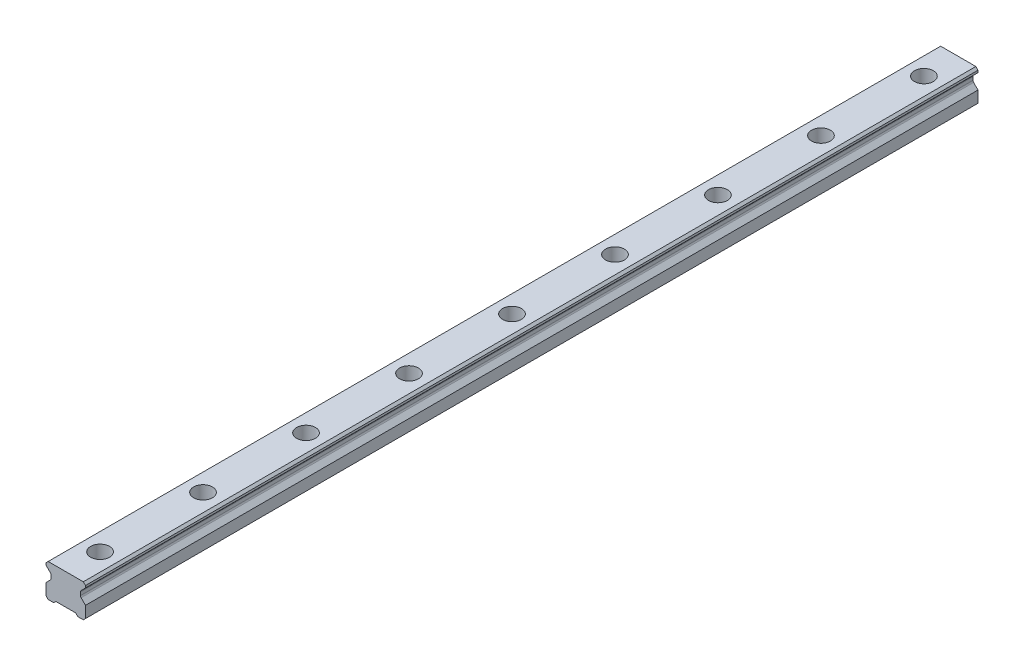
ISO-10303-21;
HEADER;
FILE_DESCRIPTION(('STEP AP214'),'2;1');
FILE_NAME('part.step','',(''),(''),'','','');
FILE_SCHEMA(('AUTOMOTIVE_DESIGN { 1 0 10303 214 1 1 1 1 }'));
ENDSEC;
DATA;
#1=APPLICATION_CONTEXT('core data for automotive mechanical design processes');
#2=APPLICATION_PROTOCOL_DEFINITION('international standard','automotive_design',2000,#1);
#3=PRODUCT_CONTEXT('',#1,'mechanical');
#4=PRODUCT('Part','Part','',(#3));
#5=PRODUCT_RELATED_PRODUCT_CATEGORY('part','',(#4));
#6=PRODUCT_DEFINITION_FORMATION('','',#4);
#7=PRODUCT_DEFINITION_CONTEXT('part definition',#1,'design');
#8=PRODUCT_DEFINITION('design','',#6,#7);
#9=PRODUCT_DEFINITION_SHAPE('','',#8);
#10=(LENGTH_UNIT() NAMED_UNIT(*) SI_UNIT(.MILLI.,.METRE.));
#11=(NAMED_UNIT(*) PLANE_ANGLE_UNIT() SI_UNIT($,.RADIAN.));
#12=(NAMED_UNIT(*) SI_UNIT($,.STERADIAN.) SOLID_ANGLE_UNIT());
#13=UNCERTAINTY_MEASURE_WITH_UNIT(LENGTH_MEASURE(1.E-05),#10,'distance_accuracy_value','');
#14=(GEOMETRIC_REPRESENTATION_CONTEXT(3) GLOBAL_UNCERTAINTY_ASSIGNED_CONTEXT((#13)) GLOBAL_UNIT_ASSIGNED_CONTEXT((#10,
#11,#12)) REPRESENTATION_CONTEXT('',''));
#15=CARTESIAN_POINT('',(0.,0.,0.));
#16=DIRECTION('',(0.,0.,1.));
#17=DIRECTION('',(1.,0.,0.));
#18=AXIS2_PLACEMENT_3D('',#15,#16,#17);
#19=CARTESIAN_POINT('',(0.,10.2,-240.));
#20=DIRECTION('',(0.,1.,0.));
#21=DIRECTION('',(0.,0.,1.));
#22=AXIS2_PLACEMENT_3D('',#19,#20,#21);
#23=PLANE('',#22);
#24=CARTESIAN_POINT('',(0.,10.2,-240.));
#25=DIRECTION('',(0.,1.,0.));
#26=DIRECTION('',(0.,0.,1.));
#27=AXIS2_PLACEMENT_3D('',#24,#25,#26);
#28=CIRCLE('',#27,3.5);
#29=CARTESIAN_POINT('',(0.,10.2,-236.5));
#30=VERTEX_POINT('',#29);
#31=EDGE_CURVE('E415',#30,#30,#28,.T.);
#32=ORIENTED_EDGE('',*,*,#31,.F.);
#33=EDGE_LOOP('',(#32));
#34=FACE_BOUND('',#33,.T.);
#35=CARTESIAN_POINT('',(0.,10.2,-240.));
#36=DIRECTION('',(0.,1.,0.));
#37=DIRECTION('',(0.,0.,1.));
#38=AXIS2_PLACEMENT_3D('',#35,#36,#37);
#39=CIRCLE('',#38,5.5);
#40=CARTESIAN_POINT('',(0.,10.2,-234.5));
#41=VERTEX_POINT('',#40);
#42=EDGE_CURVE('E11',#41,#41,#39,.T.);
#43=ORIENTED_EDGE('',*,*,#42,.T.);
#44=EDGE_LOOP('',(#43));
#45=FACE_BOUND('',#44,.T.);
#46=ADVANCED_FACE('F39',(#34,#45),#23,.T.);
#47=CARTESIAN_POINT('',(0.,10.2,-240.));
#48=DIRECTION('',(0.,1.,0.));
#49=DIRECTION('',(0.,0.,1.));
#50=AXIS2_PLACEMENT_3D('',#47,#48,#49);
#51=CYLINDRICAL_SURFACE('',#50,5.5);
#52=ORIENTED_EDGE('',*,*,#42,.F.);
#53=EDGE_LOOP('',(#52));
#54=FACE_BOUND('',#53,.T.);
#55=CARTESIAN_POINT('',(0.,19.2,-240.));
#56=DIRECTION('',(0.,1.,0.));
#57=DIRECTION('',(0.,0.,1.));
#58=AXIS2_PLACEMENT_3D('',#55,#56,#57);
#59=CIRCLE('',#58,5.5);
#60=CARTESIAN_POINT('',(0.,19.2,-234.5));
#61=VERTEX_POINT('',#60);
#62=EDGE_CURVE('E48',#61,#61,#59,.T.);
#63=ORIENTED_EDGE('',*,*,#62,.T.);
#64=EDGE_LOOP('',(#63));
#65=FACE_BOUND('',#64,.T.);
#66=ADVANCED_FACE('F688',(#54,#65),#51,.F.);
#67=CARTESIAN_POINT('',(0.,10.2,-180.));
#68=DIRECTION('',(0.,1.,0.));
#69=DIRECTION('',(0.,0.,1.));
#70=AXIS2_PLACEMENT_3D('',#67,#68,#69);
#71=PLANE('',#70);
#72=CARTESIAN_POINT('',(0.,10.2,-180.));
#73=DIRECTION('',(0.,1.,0.));
#74=DIRECTION('',(0.,0.,1.));
#75=AXIS2_PLACEMENT_3D('',#72,#73,#74);
#76=CIRCLE('',#75,3.5);
#77=CARTESIAN_POINT('',(0.,10.2,-176.5));
#78=VERTEX_POINT('',#77);
#79=EDGE_CURVE('E420',#78,#78,#76,.T.);
#80=ORIENTED_EDGE('',*,*,#79,.F.);
#81=EDGE_LOOP('',(#80));
#82=FACE_BOUND('',#81,.T.);
#83=CARTESIAN_POINT('',(0.,10.2,-180.));
#84=DIRECTION('',(0.,1.,0.));
#85=DIRECTION('',(0.,0.,1.));
#86=AXIS2_PLACEMENT_3D('',#83,#84,#85);
#87=CIRCLE('',#86,5.5);
#88=CARTESIAN_POINT('',(0.,10.2,-174.5));
#89=VERTEX_POINT('',#88);
#90=EDGE_CURVE('E399',#89,#89,#87,.T.);
#91=ORIENTED_EDGE('',*,*,#90,.T.);
#92=EDGE_LOOP('',(#91));
#93=FACE_BOUND('',#92,.T.);
#94=ADVANCED_FACE('F693',(#82,#93),#71,.T.);
#95=CARTESIAN_POINT('',(0.,10.2,-180.));
#96=DIRECTION('',(0.,1.,0.));
#97=DIRECTION('',(0.,0.,1.));
#98=AXIS2_PLACEMENT_3D('',#95,#96,#97);
#99=CYLINDRICAL_SURFACE('',#98,5.5);
#100=ORIENTED_EDGE('',*,*,#90,.F.);
#101=EDGE_LOOP('',(#100));
#102=FACE_BOUND('',#101,.T.);
#103=CARTESIAN_POINT('',(0.,19.2,-180.));
#104=DIRECTION('',(0.,1.,0.));
#105=DIRECTION('',(0.,0.,1.));
#106=AXIS2_PLACEMENT_3D('',#103,#104,#105);
#107=CIRCLE('',#106,5.5);
#108=CARTESIAN_POINT('',(0.,19.2,-174.5));
#109=VERTEX_POINT('',#108);
#110=EDGE_CURVE('E395',#109,#109,#107,.T.);
#111=ORIENTED_EDGE('',*,*,#110,.T.);
#112=EDGE_LOOP('',(#111));
#113=FACE_BOUND('',#112,.T.);
#114=ADVANCED_FACE('F777',(#102,#113),#99,.F.);
#115=CARTESIAN_POINT('',(0.,10.2,-120.));
#116=DIRECTION('',(0.,1.,0.));
#117=DIRECTION('',(0.,0.,1.));
#118=AXIS2_PLACEMENT_3D('',#115,#116,#117);
#119=PLANE('',#118);
#120=CARTESIAN_POINT('',(0.,10.2,-120.));
#121=DIRECTION('',(0.,1.,0.));
#122=DIRECTION('',(0.,0.,1.));
#123=AXIS2_PLACEMENT_3D('',#120,#121,#122);
#124=CIRCLE('',#123,3.5);
#125=CARTESIAN_POINT('',(0.,10.2,-116.5));
#126=VERTEX_POINT('',#125);
#127=EDGE_CURVE('E425',#126,#126,#124,.T.);
#128=ORIENTED_EDGE('',*,*,#127,.F.);
#129=EDGE_LOOP('',(#128));
#130=FACE_BOUND('',#129,.T.);
#131=CARTESIAN_POINT('',(0.,10.2,-120.));
#132=DIRECTION('',(0.,1.,0.));
#133=DIRECTION('',(0.,0.,1.));
#134=AXIS2_PLACEMENT_3D('',#131,#132,#133);
#135=CIRCLE('',#134,5.5);
#136=CARTESIAN_POINT('',(0.,10.2,-114.5));
#137=VERTEX_POINT('',#136);
#138=EDGE_CURVE('E391',#137,#137,#135,.T.);
#139=ORIENTED_EDGE('',*,*,#138,.T.);
#140=EDGE_LOOP('',(#139));
#141=FACE_BOUND('',#140,.T.);
#142=ADVANCED_FACE('F773',(#130,#141),#119,.T.);
#143=CARTESIAN_POINT('',(0.,10.2,-120.));
#144=DIRECTION('',(0.,1.,0.));
#145=DIRECTION('',(0.,0.,1.));
#146=AXIS2_PLACEMENT_3D('',#143,#144,#145);
#147=CYLINDRICAL_SURFACE('',#146,5.5);
#148=ORIENTED_EDGE('',*,*,#138,.F.);
#149=EDGE_LOOP('',(#148));
#150=FACE_BOUND('',#149,.T.);
#151=CARTESIAN_POINT('',(0.,19.2,-120.));
#152=DIRECTION('',(0.,1.,0.));
#153=DIRECTION('',(0.,0.,1.));
#154=AXIS2_PLACEMENT_3D('',#151,#152,#153);
#155=CIRCLE('',#154,5.5);
#156=CARTESIAN_POINT('',(0.,19.2,-114.5));
#157=VERTEX_POINT('',#156);
#158=EDGE_CURVE('E387',#157,#157,#155,.T.);
#159=ORIENTED_EDGE('',*,*,#158,.T.);
#160=EDGE_LOOP('',(#159));
#161=FACE_BOUND('',#160,.T.);
#162=ADVANCED_FACE('F769',(#150,#161),#147,.F.);
#163=CARTESIAN_POINT('',(0.,10.2,-60.));
#164=DIRECTION('',(0.,1.,0.));
#165=DIRECTION('',(0.,0.,1.));
#166=AXIS2_PLACEMENT_3D('',#163,#164,#165);
#167=PLANE('',#166);
#168=CARTESIAN_POINT('',(0.,10.2,-60.));
#169=DIRECTION('',(0.,1.,0.));
#170=DIRECTION('',(0.,0.,1.));
#171=AXIS2_PLACEMENT_3D('',#168,#169,#170);
#172=CIRCLE('',#171,3.5);
#173=CARTESIAN_POINT('',(0.,10.2,-56.5));
#174=VERTEX_POINT('',#173);
#175=EDGE_CURVE('E430',#174,#174,#172,.T.);
#176=ORIENTED_EDGE('',*,*,#175,.F.);
#177=EDGE_LOOP('',(#176));
#178=FACE_BOUND('',#177,.T.);
#179=CARTESIAN_POINT('',(0.,10.2,-60.));
#180=DIRECTION('',(0.,1.,0.));
#181=DIRECTION('',(0.,0.,1.));
#182=AXIS2_PLACEMENT_3D('',#179,#180,#181);
#183=CIRCLE('',#182,5.5);
#184=CARTESIAN_POINT('',(0.,10.2,-54.5));
#185=VERTEX_POINT('',#184);
#186=EDGE_CURVE('E383',#185,#185,#183,.T.);
#187=ORIENTED_EDGE('',*,*,#186,.T.);
#188=EDGE_LOOP('',(#187));
#189=FACE_BOUND('',#188,.T.);
#190=ADVANCED_FACE('F765',(#178,#189),#167,.T.);
#191=CARTESIAN_POINT('',(0.,10.2,-60.));
#192=DIRECTION('',(0.,1.,0.));
#193=DIRECTION('',(0.,0.,1.));
#194=AXIS2_PLACEMENT_3D('',#191,#192,#193);
#195=CYLINDRICAL_SURFACE('',#194,5.5);
#196=ORIENTED_EDGE('',*,*,#186,.F.);
#197=EDGE_LOOP('',(#196));
#198=FACE_BOUND('',#197,.T.);
#199=CARTESIAN_POINT('',(0.,19.2,-60.));
#200=DIRECTION('',(0.,1.,0.));
#201=DIRECTION('',(0.,0.,1.));
#202=AXIS2_PLACEMENT_3D('',#199,#200,#201);
#203=CIRCLE('',#202,5.5);
#204=CARTESIAN_POINT('',(0.,19.2,-54.5));
#205=VERTEX_POINT('',#204);
#206=EDGE_CURVE('E379',#205,#205,#203,.T.);
#207=ORIENTED_EDGE('',*,*,#206,.T.);
#208=EDGE_LOOP('',(#207));
#209=FACE_BOUND('',#208,.T.);
#210=ADVANCED_FACE('F761',(#198,#209),#195,.F.);
#211=CARTESIAN_POINT('',(0.,10.2,0.));
#212=DIRECTION('',(0.,1.,0.));
#213=DIRECTION('',(0.,0.,1.));
#214=AXIS2_PLACEMENT_3D('',#211,#212,#213);
#215=PLANE('',#214);
#216=CARTESIAN_POINT('',(0.,10.2,0.));
#217=DIRECTION('',(0.,1.,0.));
#218=DIRECTION('',(0.,0.,1.));
#219=AXIS2_PLACEMENT_3D('',#216,#217,#218);
#220=CIRCLE('',#219,3.5);
#221=CARTESIAN_POINT('',(0.,10.2,3.50000000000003));
#222=VERTEX_POINT('',#221);
#223=EDGE_CURVE('E434',#222,#222,#220,.T.);
#224=ORIENTED_EDGE('',*,*,#223,.F.);
#225=EDGE_LOOP('',(#224));
#226=FACE_BOUND('',#225,.T.);
#227=CARTESIAN_POINT('',(0.,10.2,0.));
#228=DIRECTION('',(0.,1.,0.));
#229=DIRECTION('',(0.,0.,1.));
#230=AXIS2_PLACEMENT_3D('',#227,#228,#229);
#231=CIRCLE('',#230,5.5);
#232=CARTESIAN_POINT('',(0.,10.2,5.50000000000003));
#233=VERTEX_POINT('',#232);
#234=EDGE_CURVE('E375',#233,#233,#231,.T.);
#235=ORIENTED_EDGE('',*,*,#234,.T.);
#236=EDGE_LOOP('',(#235));
#237=FACE_BOUND('',#236,.T.);
#238=ADVANCED_FACE('F757',(#226,#237),#215,.T.);
#239=CARTESIAN_POINT('',(0.,10.2,0.));
#240=DIRECTION('',(0.,1.,0.));
#241=DIRECTION('',(0.,0.,1.));
#242=AXIS2_PLACEMENT_3D('',#239,#240,#241);
#243=CYLINDRICAL_SURFACE('',#242,5.5);
#244=ORIENTED_EDGE('',*,*,#234,.F.);
#245=EDGE_LOOP('',(#244));
#246=FACE_BOUND('',#245,.T.);
#247=CARTESIAN_POINT('',(0.,19.2,0.));
#248=DIRECTION('',(0.,1.,0.));
#249=DIRECTION('',(0.,0.,1.));
#250=AXIS2_PLACEMENT_3D('',#247,#248,#249);
#251=CIRCLE('',#250,5.5);
#252=CARTESIAN_POINT('',(0.,19.2,5.50000000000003));
#253=VERTEX_POINT('',#252);
#254=EDGE_CURVE('E371',#253,#253,#251,.T.);
#255=ORIENTED_EDGE('',*,*,#254,.T.);
#256=EDGE_LOOP('',(#255));
#257=FACE_BOUND('',#256,.T.);
#258=ADVANCED_FACE('F753',(#246,#257),#243,.F.);
#259=CARTESIAN_POINT('',(0.,10.2,60.));
#260=DIRECTION('',(0.,1.,0.));
#261=DIRECTION('',(0.,0.,1.));
#262=AXIS2_PLACEMENT_3D('',#259,#260,#261);
#263=PLANE('',#262);
#264=CARTESIAN_POINT('',(0.,10.2,60.));
#265=DIRECTION('',(0.,1.,0.));
#266=DIRECTION('',(0.,0.,1.));
#267=AXIS2_PLACEMENT_3D('',#264,#265,#266);
#268=CIRCLE('',#267,3.5);
#269=CARTESIAN_POINT('',(0.,10.2,63.5));
#270=VERTEX_POINT('',#269);
#271=EDGE_CURVE('E438',#270,#270,#268,.T.);
#272=ORIENTED_EDGE('',*,*,#271,.F.);
#273=EDGE_LOOP('',(#272));
#274=FACE_BOUND('',#273,.T.);
#275=CARTESIAN_POINT('',(0.,10.2,60.));
#276=DIRECTION('',(0.,1.,0.));
#277=DIRECTION('',(0.,0.,1.));
#278=AXIS2_PLACEMENT_3D('',#275,#276,#277);
#279=CIRCLE('',#278,5.5);
#280=CARTESIAN_POINT('',(0.,10.2,65.5));
#281=VERTEX_POINT('',#280);
#282=EDGE_CURVE('E367',#281,#281,#279,.T.);
#283=ORIENTED_EDGE('',*,*,#282,.T.);
#284=EDGE_LOOP('',(#283));
#285=FACE_BOUND('',#284,.T.);
#286=ADVANCED_FACE('F749',(#274,#285),#263,.T.);
#287=CARTESIAN_POINT('',(0.,10.2,60.));
#288=DIRECTION('',(0.,1.,0.));
#289=DIRECTION('',(0.,0.,1.));
#290=AXIS2_PLACEMENT_3D('',#287,#288,#289);
#291=CYLINDRICAL_SURFACE('',#290,5.5);
#292=ORIENTED_EDGE('',*,*,#282,.F.);
#293=EDGE_LOOP('',(#292));
#294=FACE_BOUND('',#293,.T.);
#295=CARTESIAN_POINT('',(0.,19.2,60.));
#296=DIRECTION('',(0.,1.,0.));
#297=DIRECTION('',(0.,0.,1.));
#298=AXIS2_PLACEMENT_3D('',#295,#296,#297);
#299=CIRCLE('',#298,5.5);
#300=CARTESIAN_POINT('',(0.,19.2,65.5));
#301=VERTEX_POINT('',#300);
#302=EDGE_CURVE('E363',#301,#301,#299,.T.);
#303=ORIENTED_EDGE('',*,*,#302,.T.);
#304=EDGE_LOOP('',(#303));
#305=FACE_BOUND('',#304,.T.);
#306=ADVANCED_FACE('F745',(#294,#305),#291,.F.);
#307=CARTESIAN_POINT('',(0.,10.2,120.));
#308=DIRECTION('',(0.,1.,0.));
#309=DIRECTION('',(0.,0.,1.));
#310=AXIS2_PLACEMENT_3D('',#307,#308,#309);
#311=PLANE('',#310);
#312=CARTESIAN_POINT('',(0.,10.2,120.));
#313=DIRECTION('',(0.,1.,0.));
#314=DIRECTION('',(0.,0.,1.));
#315=AXIS2_PLACEMENT_3D('',#312,#313,#314);
#316=CIRCLE('',#315,3.5);
#317=CARTESIAN_POINT('',(0.,10.2,123.5));
#318=VERTEX_POINT('',#317);
#319=EDGE_CURVE('E453',#318,#318,#316,.T.);
#320=ORIENTED_EDGE('',*,*,#319,.F.);
#321=EDGE_LOOP('',(#320));
#322=FACE_BOUND('',#321,.T.);
#323=CARTESIAN_POINT('',(0.,10.2,120.));
#324=DIRECTION('',(0.,1.,0.));
#325=DIRECTION('',(0.,0.,1.));
#326=AXIS2_PLACEMENT_3D('',#323,#324,#325);
#327=CIRCLE('',#326,5.5);
#328=CARTESIAN_POINT('',(0.,10.2,125.5));
#329=VERTEX_POINT('',#328);
#330=EDGE_CURVE('E359',#329,#329,#327,.T.);
#331=ORIENTED_EDGE('',*,*,#330,.T.);
#332=EDGE_LOOP('',(#331));
#333=FACE_BOUND('',#332,.T.);
#334=ADVANCED_FACE('F741',(#322,#333),#311,.T.);
#335=CARTESIAN_POINT('',(0.,10.2,120.));
#336=DIRECTION('',(0.,1.,0.));
#337=DIRECTION('',(0.,0.,1.));
#338=AXIS2_PLACEMENT_3D('',#335,#336,#337);
#339=CYLINDRICAL_SURFACE('',#338,5.5);
#340=ORIENTED_EDGE('',*,*,#330,.F.);
#341=EDGE_LOOP('',(#340));
#342=FACE_BOUND('',#341,.T.);
#343=CARTESIAN_POINT('',(0.,19.2,120.));
#344=DIRECTION('',(0.,1.,0.));
#345=DIRECTION('',(0.,0.,1.));
#346=AXIS2_PLACEMENT_3D('',#343,#344,#345);
#347=CIRCLE('',#346,5.5);
#348=CARTESIAN_POINT('',(0.,19.2,125.5));
#349=VERTEX_POINT('',#348);
#350=EDGE_CURVE('E355',#349,#349,#347,.T.);
#351=ORIENTED_EDGE('',*,*,#350,.T.);
#352=EDGE_LOOP('',(#351));
#353=FACE_BOUND('',#352,.T.);
#354=ADVANCED_FACE('F738',(#342,#353),#339,.F.);
#355=CARTESIAN_POINT('',(11.5,0.,260.));
#356=DIRECTION('',(0.,1.,0.));
#357=DIRECTION('',(-1.,0.,0.));
#358=AXIS2_PLACEMENT_3D('',#355,#356,#357);
#359=PLANE('',#358);
#360=DIRECTION('',(1.,0.,0.));
#361=VECTOR('',#360,1.);
#362=CARTESIAN_POINT('',(11.5,0.,-260.));
#363=LINE('',#362,#361);
#364=CARTESIAN_POINT('',(-10.25,0.,-260.));
#365=VERTEX_POINT('',#364);
#366=CARTESIAN_POINT('',(-7.,0.,-260.));
#367=VERTEX_POINT('',#366);
#368=EDGE_CURVE('E229',#365,#367,#363,.T.);
#369=ORIENTED_EDGE('',*,*,#368,.T.);
#370=DIRECTION('',(0.,0.,1.));
#371=VECTOR('',#370,1.);
#372=CARTESIAN_POINT('',(-7.,0.,-260.));
#373=LINE('',#372,#371);
#374=CARTESIAN_POINT('',(-7.,0.,260.));
#375=VERTEX_POINT('',#374);
#376=EDGE_CURVE('E492',#367,#375,#373,.T.);
#377=ORIENTED_EDGE('',*,*,#376,.T.);
#378=DIRECTION('',(1.,0.,0.));
#379=VECTOR('',#378,1.);
#380=CARTESIAN_POINT('',(11.5,0.,260.));
#381=LINE('',#380,#379);
#382=CARTESIAN_POINT('',(-10.25,0.,260.));
#383=VERTEX_POINT('',#382);
#384=EDGE_CURVE('E561',#383,#375,#381,.T.);
#385=ORIENTED_EDGE('',*,*,#384,.F.);
#386=DIRECTION('',(0.,0.,-1.));
#387=VECTOR('',#386,1.);
#388=CARTESIAN_POINT('',(-10.25,0.,260.));
#389=LINE('',#388,#387);
#390=EDGE_CURVE('E290',#383,#365,#389,.T.);
#391=ORIENTED_EDGE('',*,*,#390,.T.);
#392=EDGE_LOOP('',(#369,#377,#385,#391));
#393=FACE_BOUND('',#392,.T.);
#394=ADVANCED_FACE('F669',(#393),#359,.F.);
#395=CARTESIAN_POINT('',(-11.5,19.2,260.));
#396=DIRECTION('',(1.,0.,0.));
#397=DIRECTION('',(0.,1.,0.));
#398=AXIS2_PLACEMENT_3D('',#395,#396,#397);
#399=PLANE('',#398);
#400=DIRECTION('',(0.,-1.,0.));
#401=VECTOR('',#400,1.);
#402=CARTESIAN_POINT('',(-11.5,19.2,260.));
#403=LINE('',#402,#401);
#404=CARTESIAN_POINT('',(-11.5,17.95,260.));
#405=VERTEX_POINT('',#404);
#406=CARTESIAN_POINT('',(-11.5,16.7,260.));
#407=VERTEX_POINT('',#406);
#408=EDGE_CURVE('E558',#405,#407,#403,.T.);
#409=ORIENTED_EDGE('',*,*,#408,.F.);
#410=DIRECTION('',(0.,0.,-1.));
#411=VECTOR('',#410,1.);
#412=CARTESIAN_POINT('',(-11.5,17.95,260.));
#413=LINE('',#412,#411);
#414=CARTESIAN_POINT('',(-11.5,17.95,-260.));
#415=VERTEX_POINT('',#414);
#416=EDGE_CURVE('E252',#405,#415,#413,.T.);
#417=ORIENTED_EDGE('',*,*,#416,.T.);
#418=DIRECTION('',(0.,-1.,0.));
#419=VECTOR('',#418,1.);
#420=CARTESIAN_POINT('',(-11.5,19.2,-260.));
#421=LINE('',#420,#419);
#422=CARTESIAN_POINT('',(-11.5,16.7,-260.));
#423=VERTEX_POINT('',#422);
#424=EDGE_CURVE('E230',#415,#423,#421,.T.);
#425=ORIENTED_EDGE('',*,*,#424,.T.);
#426=DIRECTION('',(0.,0.,1.));
#427=VECTOR('',#426,1.);
#428=CARTESIAN_POINT('',(-11.5,16.7,-260.));
#429=LINE('',#428,#427);
#430=EDGE_CURVE('E513',#423,#407,#429,.T.);
#431=ORIENTED_EDGE('',*,*,#430,.T.);
#432=EDGE_LOOP('',(#409,#417,#425,#431));
#433=FACE_BOUND('',#432,.T.);
#434=ADVANCED_FACE('F586',(#433),#399,.F.);
#435=CARTESIAN_POINT('',(11.5,19.2,260.));
#436=DIRECTION('',(-1.,0.,0.));
#437=DIRECTION('',(0.,0.,1.));
#438=AXIS2_PLACEMENT_3D('',#435,#436,#437);
#439=PLANE('',#438);
#440=DIRECTION('',(0.,1.,0.));
#441=VECTOR('',#440,1.);
#442=CARTESIAN_POINT('',(11.5,19.2,260.));
#443=LINE('',#442,#441);
#444=CARTESIAN_POINT('',(11.5,1.25000000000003,260.));
#445=VERTEX_POINT('',#444);
#446=CARTESIAN_POINT('',(11.5,7.95,260.));
#447=VERTEX_POINT('',#446);
#448=EDGE_CURVE('E566',#445,#447,#443,.T.);
#449=ORIENTED_EDGE('',*,*,#448,.F.);
#450=DIRECTION('',(0.,0.,-1.));
#451=VECTOR('',#450,1.);
#452=CARTESIAN_POINT('',(11.5,1.25000000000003,260.));
#453=LINE('',#452,#451);
#454=CARTESIAN_POINT('',(11.5,1.25000000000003,-260.));
#455=VERTEX_POINT('',#454);
#456=EDGE_CURVE('E297',#445,#455,#453,.T.);
#457=ORIENTED_EDGE('',*,*,#456,.T.);
#458=DIRECTION('',(0.,1.,0.));
#459=VECTOR('',#458,1.);
#460=CARTESIAN_POINT('',(11.5,19.2,-260.));
#461=LINE('',#460,#459);
#462=CARTESIAN_POINT('',(11.5,7.95,-260.));
#463=VERTEX_POINT('',#462);
#464=EDGE_CURVE('E243',#455,#463,#461,.T.);
#465=ORIENTED_EDGE('',*,*,#464,.T.);
#466=DIRECTION('',(0.,0.,1.));
#467=VECTOR('',#466,1.);
#468=CARTESIAN_POINT('',(11.5,7.95,-260.));
#469=LINE('',#468,#467);
#470=EDGE_CURVE('E543',#463,#447,#469,.T.);
#471=ORIENTED_EDGE('',*,*,#470,.T.);
#472=EDGE_LOOP('',(#449,#457,#465,#471));
#473=FACE_BOUND('',#472,.T.);
#474=ADVANCED_FACE('F629',(#473),#439,.F.);
#475=CARTESIAN_POINT('',(-11.5,7.95,-260.));
#476=VERTEX_POINT('',#475);
#477=CARTESIAN_POINT('',(-11.5,1.24999999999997,-260.));
#478=VERTEX_POINT('',#477);
#479=EDGE_CURVE('E239',#476,#478,#421,.T.);
#480=ORIENTED_EDGE('',*,*,#479,.T.);
#481=DIRECTION('',(0.,0.,1.));
#482=VECTOR('',#481,1.);
#483=CARTESIAN_POINT('',(-11.5,1.24999999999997,260.));
#484=LINE('',#483,#482);
#485=CARTESIAN_POINT('',(-11.5,1.24999999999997,260.));
#486=VERTEX_POINT('',#485);
#487=EDGE_CURVE('E294',#478,#486,#484,.T.);
#488=ORIENTED_EDGE('',*,*,#487,.T.);
#489=CARTESIAN_POINT('',(-11.5,7.95,260.));
#490=VERTEX_POINT('',#489);
#491=EDGE_CURVE('E251',#490,#486,#403,.T.);
#492=ORIENTED_EDGE('',*,*,#491,.F.);
#493=DIRECTION('',(0.,0.,1.));
#494=VECTOR('',#493,1.);
#495=CARTESIAN_POINT('',(-11.5,7.95,-260.));
#496=LINE('',#495,#494);
#497=EDGE_CURVE('E525',#476,#490,#496,.T.);
#498=ORIENTED_EDGE('',*,*,#497,.F.);
#499=EDGE_LOOP('',(#480,#488,#492,#498));
#500=FACE_BOUND('',#499,.T.);
#501=ADVANCED_FACE('F614',(#500),#399,.F.);
#502=CARTESIAN_POINT('',(7.,0.,260.));
#503=VERTEX_POINT('',#502);
#504=CARTESIAN_POINT('',(10.25,0.,260.));
#505=VERTEX_POINT('',#504);
#506=EDGE_CURVE('E219',#503,#505,#381,.T.);
#507=ORIENTED_EDGE('',*,*,#506,.F.);
#508=DIRECTION('',(0.,0.,1.));
#509=VECTOR('',#508,1.);
#510=CARTESIAN_POINT('',(7.,0.,-260.));
#511=LINE('',#510,#509);
#512=CARTESIAN_POINT('',(7.,0.,-260.));
#513=VERTEX_POINT('',#512);
#514=EDGE_CURVE('E206',#513,#503,#511,.T.);
#515=ORIENTED_EDGE('',*,*,#514,.F.);
#516=CARTESIAN_POINT('',(10.25,0.,-260.));
#517=VERTEX_POINT('',#516);
#518=EDGE_CURVE('E217',#513,#517,#363,.T.);
#519=ORIENTED_EDGE('',*,*,#518,.T.);
#520=DIRECTION('',(0.,0.,1.));
#521=VECTOR('',#520,1.);
#522=CARTESIAN_POINT('',(10.25,0.,260.));
#523=LINE('',#522,#521);
#524=EDGE_CURVE('E287',#517,#505,#523,.T.);
#525=ORIENTED_EDGE('',*,*,#524,.T.);
#526=EDGE_LOOP('',(#507,#515,#519,#525));
#527=FACE_BOUND('',#526,.T.);
#528=ADVANCED_FACE('F215',(#527),#359,.F.);
#529=CARTESIAN_POINT('',(11.5,16.7,-260.));
#530=VERTEX_POINT('',#529);
#531=CARTESIAN_POINT('',(11.5,17.95,-260.));
#532=VERTEX_POINT('',#531);
#533=EDGE_CURVE('E236',#530,#532,#461,.T.);
#534=ORIENTED_EDGE('',*,*,#533,.T.);
#535=DIRECTION('',(0.,0.,1.));
#536=VECTOR('',#535,1.);
#537=CARTESIAN_POINT('',(11.5,17.95,260.));
#538=LINE('',#537,#536);
#539=CARTESIAN_POINT('',(11.5,17.95,260.));
#540=VERTEX_POINT('',#539);
#541=EDGE_CURVE('E301',#532,#540,#538,.T.);
#542=ORIENTED_EDGE('',*,*,#541,.T.);
#543=CARTESIAN_POINT('',(11.5,16.7,260.));
#544=VERTEX_POINT('',#543);
#545=EDGE_CURVE('E565',#544,#540,#443,.T.);
#546=ORIENTED_EDGE('',*,*,#545,.F.);
#547=DIRECTION('',(0.,0.,1.));
#548=VECTOR('',#547,1.);
#549=CARTESIAN_POINT('',(11.5,16.7,-260.));
#550=LINE('',#549,#548);
#551=EDGE_CURVE('E518',#530,#544,#550,.T.);
#552=ORIENTED_EDGE('',*,*,#551,.F.);
#553=EDGE_LOOP('',(#534,#542,#546,#552));
#554=FACE_BOUND('',#553,.T.);
#555=ADVANCED_FACE('F657',(#554),#439,.F.);
#556=CARTESIAN_POINT('',(11.5,19.2,260.));
#557=DIRECTION('',(0.,-1.,0.));
#558=DIRECTION('',(0.,0.,-1.));
#559=AXIS2_PLACEMENT_3D('',#556,#557,#558);
#560=PLANE('',#559);
#561=CARTESIAN_POINT('',(0.,19.2,180.));
#562=DIRECTION('',(0.,1.,0.));
#563=DIRECTION('',(0.,0.,1.));
#564=AXIS2_PLACEMENT_3D('',#561,#562,#563);
#565=CIRCLE('',#564,5.5);
#566=CARTESIAN_POINT('',(0.,19.2,185.5));
#567=VERTEX_POINT('',#566);
#568=EDGE_CURVE('E457',#567,#567,#565,.T.);
#569=ORIENTED_EDGE('',*,*,#568,.F.);
#570=EDGE_LOOP('',(#569));
#571=FACE_BOUND('',#570,.T.);
#572=CARTESIAN_POINT('',(0.,19.2,240.));
#573=DIRECTION('',(0.,1.,0.));
#574=DIRECTION('',(0.,0.,1.));
#575=AXIS2_PLACEMENT_3D('',#572,#573,#574);
#576=CIRCLE('',#575,5.5);
#577=CARTESIAN_POINT('',(0.,19.2,245.5));
#578=VERTEX_POINT('',#577);
#579=EDGE_CURVE('E472',#578,#578,#576,.T.);
#580=ORIENTED_EDGE('',*,*,#579,.F.);
#581=EDGE_LOOP('',(#580));
#582=FACE_BOUND('',#581,.T.);
#583=DIRECTION('',(-1.,0.,0.));
#584=VECTOR('',#583,1.);
#585=CARTESIAN_POINT('',(11.5,19.2,-260.));
#586=LINE('',#585,#584);
#587=CARTESIAN_POINT('',(10.25,19.2,-260.));
#588=VERTEX_POINT('',#587);
#589=CARTESIAN_POINT('',(-10.2499999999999,19.2,-260.));
#590=VERTEX_POINT('',#589);
#591=EDGE_CURVE('E247',#588,#590,#586,.T.);
#592=ORIENTED_EDGE('',*,*,#591,.T.);
#593=DIRECTION('',(0.,0.,1.));
#594=VECTOR('',#593,1.);
#595=CARTESIAN_POINT('',(-10.2499999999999,19.2,260.));
#596=LINE('',#595,#594);
#597=CARTESIAN_POINT('',(-10.2499999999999,19.2,260.));
#598=VERTEX_POINT('',#597);
#599=EDGE_CURVE('E272',#590,#598,#596,.T.);
#600=ORIENTED_EDGE('',*,*,#599,.T.);
#601=DIRECTION('',(-1.,0.,0.));
#602=VECTOR('',#601,1.);
#603=CARTESIAN_POINT('',(11.5,19.2,260.));
#604=LINE('',#603,#602);
#605=CARTESIAN_POINT('',(10.25,19.2,260.));
#606=VERTEX_POINT('',#605);
#607=EDGE_CURVE('E257',#606,#598,#604,.T.);
#608=ORIENTED_EDGE('',*,*,#607,.F.);
#609=DIRECTION('',(0.,0.,-1.));
#610=VECTOR('',#609,1.);
#611=CARTESIAN_POINT('',(10.25,19.2,260.));
#612=LINE('',#611,#610);
#613=EDGE_CURVE('E268',#606,#588,#612,.T.);
#614=ORIENTED_EDGE('',*,*,#613,.T.);
#615=EDGE_LOOP('',(#592,#600,#608,#614));
#616=FACE_BOUND('',#615,.T.);
#617=ORIENTED_EDGE('',*,*,#350,.F.);
#618=EDGE_LOOP('',(#617));
#619=FACE_BOUND('',#618,.T.);
#620=ORIENTED_EDGE('',*,*,#302,.F.);
#621=EDGE_LOOP('',(#620));
#622=FACE_BOUND('',#621,.T.);
#623=ORIENTED_EDGE('',*,*,#254,.F.);
#624=EDGE_LOOP('',(#623));
#625=FACE_BOUND('',#624,.T.);
#626=ORIENTED_EDGE('',*,*,#206,.F.);
#627=EDGE_LOOP('',(#626));
#628=FACE_BOUND('',#627,.T.);
#629=ORIENTED_EDGE('',*,*,#158,.F.);
#630=EDGE_LOOP('',(#629));
#631=FACE_BOUND('',#630,.T.);
#632=ORIENTED_EDGE('',*,*,#110,.F.);
#633=EDGE_LOOP('',(#632));
#634=FACE_BOUND('',#633,.T.);
#635=ORIENTED_EDGE('',*,*,#62,.F.);
#636=EDGE_LOOP('',(#635));
#637=FACE_BOUND('',#636,.T.);
#638=ADVANCED_FACE('F702',(#571,#582,#616,#619,#622,#625,#628,#631,#634,#637),#560,.F.);
#639=CARTESIAN_POINT('',(0.,0.,260.));
#640=DIRECTION('',(0.,0.,-1.));
#641=DIRECTION('',(-1.,0.,0.));
#642=AXIS2_PLACEMENT_3D('',#639,#640,#641);
#643=PLANE('',#642);
#644=ORIENTED_EDGE('',*,*,#384,.T.);
#645=DIRECTION('',(-0.707106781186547,-0.707106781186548,0.));
#646=VECTOR('',#645,1.);
#647=CARTESIAN_POINT('',(-7.,0.,260.));
#648=LINE('',#647,#646);
#649=CARTESIAN_POINT('',(-5.75,1.25,260.));
#650=VERTEX_POINT('',#649);
#651=EDGE_CURVE('E211',#650,#375,#648,.T.);
#652=ORIENTED_EDGE('',*,*,#651,.F.);
#653=DIRECTION('',(-1.,0.,0.));
#654=VECTOR('',#653,1.);
#655=CARTESIAN_POINT('',(-5.75,1.25,260.));
#656=LINE('',#655,#654);
#657=CARTESIAN_POINT('',(5.75,1.25,260.));
#658=VERTEX_POINT('',#657);
#659=EDGE_CURVE('E487',#658,#650,#656,.T.);
#660=ORIENTED_EDGE('',*,*,#659,.F.);
#661=DIRECTION('',(-0.707106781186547,0.707106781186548,0.));
#662=VECTOR('',#661,1.);
#663=CARTESIAN_POINT('',(5.75,1.25,260.));
#664=LINE('',#663,#662);
#665=EDGE_CURVE('E477',#503,#658,#664,.T.);
#666=ORIENTED_EDGE('',*,*,#665,.F.);
#667=ORIENTED_EDGE('',*,*,#506,.T.);
#668=DIRECTION('',(-0.707106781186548,-0.707106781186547,0.));
#669=VECTOR('',#668,1.);
#670=CARTESIAN_POINT('',(11.5,1.25000000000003,260.));
#671=LINE('',#670,#669);
#672=EDGE_CURVE('E278',#505,#445,#671,.F.);
#673=ORIENTED_EDGE('',*,*,#672,.T.);
#674=ORIENTED_EDGE('',*,*,#448,.T.);
#675=DIRECTION('',(0.707106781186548,-0.707106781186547,0.));
#676=VECTOR('',#675,1.);
#677=CARTESIAN_POINT('',(11.5,7.95,260.));
#678=LINE('',#677,#676);
#679=CARTESIAN_POINT('',(8.94944985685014,10.5005501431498,260.));
#680=VERTEX_POINT('',#679);
#681=EDGE_CURVE('E496',#680,#447,#678,.T.);
#682=ORIENTED_EDGE('',*,*,#681,.F.);
#683=CARTESIAN_POINT('',(9.83333333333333,11.384433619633,260.));
#684=DIRECTION('',(0.,0.,-1.));
#685=DIRECTION('',(-1.,0.,0.));
#686=AXIS2_PLACEMENT_3D('',#683,#684,#685);
#687=CIRCLE('',#686,1.25);
#688=CARTESIAN_POINT('',(8.58333333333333,11.384433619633,260.));
#689=VERTEX_POINT('',#688);
#690=EDGE_CURVE('E332',#680,#689,#687,.T.);
#691=ORIENTED_EDGE('',*,*,#690,.T.);
#692=DIRECTION('',(0.,-1.,0.));
#693=VECTOR('',#692,1.);
#694=CARTESIAN_POINT('',(8.58333333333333,10.8666666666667,260.));
#695=LINE('',#694,#693);
#696=CARTESIAN_POINT('',(8.58333333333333,13.265566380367,260.));
#697=VERTEX_POINT('',#696);
#698=EDGE_CURVE('E535',#697,#689,#695,.T.);
#699=ORIENTED_EDGE('',*,*,#698,.F.);
#700=CARTESIAN_POINT('',(9.83333333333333,13.265566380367,260.));
#701=DIRECTION('',(0.,0.,-1.));
#702=DIRECTION('',(-1.,0.,0.));
#703=AXIS2_PLACEMENT_3D('',#700,#701,#702);
#704=CIRCLE('',#703,1.25);
#705=CARTESIAN_POINT('',(8.94944985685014,14.1494498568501,260.));
#706=VERTEX_POINT('',#705);
#707=EDGE_CURVE('E338',#697,#706,#704,.T.);
#708=ORIENTED_EDGE('',*,*,#707,.T.);
#709=DIRECTION('',(-0.707106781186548,-0.707106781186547,0.));
#710=VECTOR('',#709,1.);
#711=CARTESIAN_POINT('',(8.58333333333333,13.7833333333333,260.));
#712=LINE('',#711,#710);
#713=EDGE_CURVE('E546',#544,#706,#712,.T.);
#714=ORIENTED_EDGE('',*,*,#713,.F.);
#715=ORIENTED_EDGE('',*,*,#545,.T.);
#716=DIRECTION('',(0.707106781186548,-0.707106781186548,0.));
#717=VECTOR('',#716,1.);
#718=CARTESIAN_POINT('',(10.25,19.2,260.));
#719=LINE('',#718,#717);
#720=EDGE_CURVE('E275',#540,#606,#719,.F.);
#721=ORIENTED_EDGE('',*,*,#720,.T.);
#722=ORIENTED_EDGE('',*,*,#607,.T.);
#723=DIRECTION('',(0.707106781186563,0.707106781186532,0.));
#724=VECTOR('',#723,1.);
#725=CARTESIAN_POINT('',(-11.5,17.95,260.));
#726=LINE('',#725,#724);
#727=EDGE_CURVE('E284',#598,#405,#726,.F.);
#728=ORIENTED_EDGE('',*,*,#727,.T.);
#729=ORIENTED_EDGE('',*,*,#408,.T.);
#730=DIRECTION('',(-0.707106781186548,0.707106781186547,0.));
#731=VECTOR('',#730,1.);
#732=CARTESIAN_POINT('',(-8.58333333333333,13.7833333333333,260.));
#733=LINE('',#732,#731);
#734=CARTESIAN_POINT('',(-8.94944985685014,14.1494498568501,260.));
#735=VERTEX_POINT('',#734);
#736=EDGE_CURVE('E514',#735,#407,#733,.T.);
#737=ORIENTED_EDGE('',*,*,#736,.F.);
#738=CARTESIAN_POINT('',(-9.83333333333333,13.265566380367,260.));
#739=DIRECTION('',(0.,0.,-1.));
#740=DIRECTION('',(-1.,0.,0.));
#741=AXIS2_PLACEMENT_3D('',#738,#739,#740);
#742=CIRCLE('',#741,1.25);
#743=CARTESIAN_POINT('',(-8.58333333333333,13.265566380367,260.));
#744=VERTEX_POINT('',#743);
#745=EDGE_CURVE('E350',#735,#744,#742,.T.);
#746=ORIENTED_EDGE('',*,*,#745,.T.);
#747=DIRECTION('',(0.,1.,0.));
#748=VECTOR('',#747,1.);
#749=CARTESIAN_POINT('',(-8.58333333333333,10.8666666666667,260.));
#750=LINE('',#749,#748);
#751=CARTESIAN_POINT('',(-8.58333333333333,11.384433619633,260.));
#752=VERTEX_POINT('',#751);
#753=EDGE_CURVE('E506',#752,#744,#750,.T.);
#754=ORIENTED_EDGE('',*,*,#753,.F.);
#755=CARTESIAN_POINT('',(-9.83333333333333,11.384433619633,260.));
#756=DIRECTION('',(0.,0.,-1.));
#757=DIRECTION('',(-1.,0.,0.));
#758=AXIS2_PLACEMENT_3D('',#755,#756,#757);
#759=CIRCLE('',#758,1.25);
#760=CARTESIAN_POINT('',(-8.94944985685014,10.5005501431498,260.));
#761=VERTEX_POINT('',#760);
#762=EDGE_CURVE('E344',#752,#761,#759,.T.);
#763=ORIENTED_EDGE('',*,*,#762,.T.);
#764=DIRECTION('',(0.707106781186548,0.707106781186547,0.));
#765=VECTOR('',#764,1.);
#766=CARTESIAN_POINT('',(-11.5,7.95,260.));
#767=LINE('',#766,#765);
#768=EDGE_CURVE('E517',#490,#761,#767,.T.);
#769=ORIENTED_EDGE('',*,*,#768,.F.);
#770=ORIENTED_EDGE('',*,*,#491,.T.);
#771=DIRECTION('',(-0.707106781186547,0.707106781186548,0.));
#772=VECTOR('',#771,1.);
#773=CARTESIAN_POINT('',(-10.25,0.,260.));
#774=LINE('',#773,#772);
#775=EDGE_CURVE('E281',#486,#383,#774,.F.);
#776=ORIENTED_EDGE('',*,*,#775,.T.);
#777=EDGE_LOOP('',(#644,#652,#660,#666,#667,#673,#674,#682,#691,#699,#708,#714,#715,#721,#722,
#728,#729,#737,#746,#754,#763,#769,#770,#776));
#778=FACE_BOUND('',#777,.T.);
#779=ADVANCED_FACE('F574',(#778),#643,.F.);
#780=CARTESIAN_POINT('',(0.,0.,-260.));
#781=DIRECTION('',(0.,0.,-1.));
#782=DIRECTION('',(-1.,0.,0.));
#783=AXIS2_PLACEMENT_3D('',#780,#781,#782);
#784=PLANE('',#783);
#785=DIRECTION('',(-0.707106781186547,-0.707106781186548,0.));
#786=VECTOR('',#785,1.);
#787=CARTESIAN_POINT('',(-7.,0.,-260.));
#788=LINE('',#787,#786);
#789=CARTESIAN_POINT('',(-5.75,1.25,-260.));
#790=VERTEX_POINT('',#789);
#791=EDGE_CURVE('E221',#790,#367,#788,.T.);
#792=ORIENTED_EDGE('',*,*,#791,.T.);
#793=ORIENTED_EDGE('',*,*,#368,.F.);
#794=DIRECTION('',(0.707106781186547,-0.707106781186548,0.));
#795=VECTOR('',#794,1.);
#796=CARTESIAN_POINT('',(-5.12500000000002,-5.12500000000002,-260.));
#797=LINE('',#796,#795);
#798=EDGE_CURVE('E262',#365,#478,#797,.F.);
#799=ORIENTED_EDGE('',*,*,#798,.T.);
#800=ORIENTED_EDGE('',*,*,#479,.F.);
#801=DIRECTION('',(0.707106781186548,0.707106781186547,0.));
#802=VECTOR('',#801,1.);
#803=CARTESIAN_POINT('',(-11.5,7.95,-260.));
#804=LINE('',#803,#802);
#805=CARTESIAN_POINT('',(-8.94944985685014,10.5005501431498,-260.));
#806=VERTEX_POINT('',#805);
#807=EDGE_CURVE('E505',#476,#806,#804,.T.);
#808=ORIENTED_EDGE('',*,*,#807,.T.);
#809=CARTESIAN_POINT('',(-9.83333333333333,11.384433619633,-260.));
#810=DIRECTION('',(0.,0.,-1.));
#811=DIRECTION('',(-1.,0.,0.));
#812=AXIS2_PLACEMENT_3D('',#809,#810,#811);
#813=CIRCLE('',#812,1.25);
#814=CARTESIAN_POINT('',(-8.58333333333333,11.384433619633,-260.));
#815=VERTEX_POINT('',#814);
#816=EDGE_CURVE('E347',#806,#815,#813,.F.);
#817=ORIENTED_EDGE('',*,*,#816,.T.);
#818=DIRECTION('',(0.,1.,0.));
#819=VECTOR('',#818,1.);
#820=CARTESIAN_POINT('',(-8.58333333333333,10.8666666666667,-260.));
#821=LINE('',#820,#819);
#822=CARTESIAN_POINT('',(-8.58333333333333,13.265566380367,-260.));
#823=VERTEX_POINT('',#822);
#824=EDGE_CURVE('E510',#815,#823,#821,.T.);
#825=ORIENTED_EDGE('',*,*,#824,.T.);
#826=CARTESIAN_POINT('',(-9.83333333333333,13.265566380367,-260.));
#827=DIRECTION('',(0.,0.,-1.));
#828=DIRECTION('',(-1.,0.,0.));
#829=AXIS2_PLACEMENT_3D('',#826,#827,#828);
#830=CIRCLE('',#829,1.25);
#831=CARTESIAN_POINT('',(-8.94944985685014,14.1494498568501,-260.));
#832=VERTEX_POINT('',#831);
#833=EDGE_CURVE('E64',#823,#832,#830,.F.);
#834=ORIENTED_EDGE('',*,*,#833,.T.);
#835=DIRECTION('',(-0.707106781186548,0.707106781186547,0.));
#836=VECTOR('',#835,1.);
#837=CARTESIAN_POINT('',(-8.58333333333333,13.7833333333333,-260.));
#838=LINE('',#837,#836);
#839=EDGE_CURVE('E502',#832,#423,#838,.T.);
#840=ORIENTED_EDGE('',*,*,#839,.T.);
#841=ORIENTED_EDGE('',*,*,#424,.F.);
#842=DIRECTION('',(-0.707106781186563,-0.707106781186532,0.));
#843=VECTOR('',#842,1.);
#844=CARTESIAN_POINT('',(-14.7249999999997,14.7250000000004,-260.));
#845=LINE('',#844,#843);
#846=EDGE_CURVE('E265',#415,#590,#845,.F.);
#847=ORIENTED_EDGE('',*,*,#846,.T.);
#848=ORIENTED_EDGE('',*,*,#591,.F.);
#849=DIRECTION('',(-0.707106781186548,0.707106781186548,0.));
#850=VECTOR('',#849,1.);
#851=CARTESIAN_POINT('',(14.725,14.725,-260.));
#852=LINE('',#851,#850);
#853=EDGE_CURVE('E256',#588,#532,#852,.F.);
#854=ORIENTED_EDGE('',*,*,#853,.T.);
#855=ORIENTED_EDGE('',*,*,#533,.F.);
#856=DIRECTION('',(-0.707106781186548,-0.707106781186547,0.));
#857=VECTOR('',#856,1.);
#858=CARTESIAN_POINT('',(8.58333333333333,13.7833333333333,-260.));
#859=LINE('',#858,#857);
#860=CARTESIAN_POINT('',(8.94944985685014,14.1494498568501,-260.));
#861=VERTEX_POINT('',#860);
#862=EDGE_CURVE('E534',#530,#861,#859,.T.);
#863=ORIENTED_EDGE('',*,*,#862,.T.);
#864=CARTESIAN_POINT('',(9.83333333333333,13.265566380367,-260.));
#865=DIRECTION('',(0.,0.,-1.));
#866=DIRECTION('',(-1.,0.,0.));
#867=AXIS2_PLACEMENT_3D('',#864,#865,#866);
#868=CIRCLE('',#867,1.25);
#869=CARTESIAN_POINT('',(8.58333333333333,13.265566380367,-260.));
#870=VERTEX_POINT('',#869);
#871=EDGE_CURVE('E341',#861,#870,#868,.F.);
#872=ORIENTED_EDGE('',*,*,#871,.T.);
#873=DIRECTION('',(0.,-1.,0.));
#874=VECTOR('',#873,1.);
#875=CARTESIAN_POINT('',(8.58333333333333,10.8666666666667,-260.));
#876=LINE('',#875,#874);
#877=CARTESIAN_POINT('',(8.58333333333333,11.384433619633,-260.));
#878=VERTEX_POINT('',#877);
#879=EDGE_CURVE('E539',#870,#878,#876,.T.);
#880=ORIENTED_EDGE('',*,*,#879,.T.);
#881=CARTESIAN_POINT('',(9.83333333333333,11.384433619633,-260.));
#882=DIRECTION('',(0.,0.,-1.));
#883=DIRECTION('',(-1.,0.,0.));
#884=AXIS2_PLACEMENT_3D('',#881,#882,#883);
#885=CIRCLE('',#884,1.25);
#886=CARTESIAN_POINT('',(8.94944985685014,10.5005501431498,-260.));
#887=VERTEX_POINT('',#886);
#888=EDGE_CURVE('E335',#878,#887,#885,.F.);
#889=ORIENTED_EDGE('',*,*,#888,.T.);
#890=DIRECTION('',(0.707106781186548,-0.707106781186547,0.));
#891=VECTOR('',#890,1.);
#892=CARTESIAN_POINT('',(11.5,7.95,-260.));
#893=LINE('',#892,#891);
#894=EDGE_CURVE('E531',#887,#463,#893,.T.);
#895=ORIENTED_EDGE('',*,*,#894,.T.);
#896=ORIENTED_EDGE('',*,*,#464,.F.);
#897=DIRECTION('',(0.707106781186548,0.707106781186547,0.));
#898=VECTOR('',#897,1.);
#899=CARTESIAN_POINT('',(5.12499999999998,-5.12499999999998,-260.));
#900=LINE('',#899,#898);
#901=EDGE_CURVE('E226',#455,#517,#900,.F.);
#902=ORIENTED_EDGE('',*,*,#901,.T.);
#903=ORIENTED_EDGE('',*,*,#518,.F.);
#904=DIRECTION('',(-0.707106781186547,0.707106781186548,0.));
#905=VECTOR('',#904,1.);
#906=CARTESIAN_POINT('',(5.75,1.25,-260.));
#907=LINE('',#906,#905);
#908=CARTESIAN_POINT('',(5.75,1.25,-260.));
#909=VERTEX_POINT('',#908);
#910=EDGE_CURVE('E202',#513,#909,#907,.T.);
#911=ORIENTED_EDGE('',*,*,#910,.T.);
#912=DIRECTION('',(-1.,0.,0.));
#913=VECTOR('',#912,1.);
#914=CARTESIAN_POINT('',(-5.75,1.25,-260.));
#915=LINE('',#914,#913);
#916=EDGE_CURVE('E56',#909,#790,#915,.T.);
#917=ORIENTED_EDGE('',*,*,#916,.T.);
#918=EDGE_LOOP('',(#792,#793,#799,#800,#808,#817,#825,#834,#840,#841,#847,#848,#854,#855,#863,
#872,#880,#889,#895,#896,#902,#903,#911,#917));
#919=FACE_BOUND('',#918,.T.);
#920=ADVANCED_FACE('F224',(#919),#784,.T.);
#921=CARTESIAN_POINT('',(11.5,7.95,-260.));
#922=DIRECTION('',(-0.707106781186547,-0.707106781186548,0.));
#923=DIRECTION('',(0.707106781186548,-0.707106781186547,0.));
#924=AXIS2_PLACEMENT_3D('',#921,#922,#923);
#925=PLANE('',#924);
#926=ORIENTED_EDGE('',*,*,#894,.F.);
#927=DIRECTION('',(0.,0.,1.));
#928=VECTOR('',#927,1.);
#929=CARTESIAN_POINT('',(8.94944985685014,10.5005501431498,260.));
#930=LINE('',#929,#928);
#931=EDGE_CURVE('E304',#887,#680,#930,.T.);
#932=ORIENTED_EDGE('',*,*,#931,.T.);
#933=ORIENTED_EDGE('',*,*,#681,.T.);
#934=ORIENTED_EDGE('',*,*,#470,.F.);
#935=EDGE_LOOP('',(#926,#932,#933,#934));
#936=FACE_BOUND('',#935,.T.);
#937=ADVANCED_FACE('F635',(#936),#925,.F.);
#938=CARTESIAN_POINT('',(8.58333333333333,10.8666666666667,-260.));
#939=DIRECTION('',(-1.,0.,0.));
#940=DIRECTION('',(0.,0.,1.));
#941=AXIS2_PLACEMENT_3D('',#938,#939,#940);
#942=PLANE('',#941);
#943=ORIENTED_EDGE('',*,*,#698,.T.);
#944=DIRECTION('',(0.,0.,1.));
#945=VECTOR('',#944,1.);
#946=CARTESIAN_POINT('',(8.58333333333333,11.384433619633,-260.));
#947=LINE('',#946,#945);
#948=EDGE_CURVE('E312',#689,#878,#947,.F.);
#949=ORIENTED_EDGE('',*,*,#948,.T.);
#950=ORIENTED_EDGE('',*,*,#879,.F.);
#951=DIRECTION('',(0.,0.,1.));
#952=VECTOR('',#951,1.);
#953=CARTESIAN_POINT('',(8.58333333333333,13.265566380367,260.));
#954=LINE('',#953,#952);
#955=EDGE_CURVE('E308',#870,#697,#954,.T.);
#956=ORIENTED_EDGE('',*,*,#955,.T.);
#957=EDGE_LOOP('',(#943,#949,#950,#956));
#958=FACE_BOUND('',#957,.T.);
#959=ADVANCED_FACE('F642',(#958),#942,.F.);
#960=CARTESIAN_POINT('',(8.58333333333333,13.7833333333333,-260.));
#961=DIRECTION('',(-0.707106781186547,0.707106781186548,0.));
#962=DIRECTION('',(-0.707106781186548,-0.707106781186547,0.));
#963=AXIS2_PLACEMENT_3D('',#960,#961,#962);
#964=PLANE('',#963);
#965=ORIENTED_EDGE('',*,*,#713,.T.);
#966=DIRECTION('',(0.,0.,1.));
#967=VECTOR('',#966,1.);
#968=CARTESIAN_POINT('',(8.94944985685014,14.1494498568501,-260.));
#969=LINE('',#968,#967);
#970=EDGE_CURVE('E315',#706,#861,#969,.F.);
#971=ORIENTED_EDGE('',*,*,#970,.T.);
#972=ORIENTED_EDGE('',*,*,#862,.F.);
#973=ORIENTED_EDGE('',*,*,#551,.T.);
#974=EDGE_LOOP('',(#965,#971,#972,#973));
#975=FACE_BOUND('',#974,.T.);
#976=ADVANCED_FACE('F652',(#975),#964,.F.);
#977=CARTESIAN_POINT('',(-8.58333333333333,13.7833333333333,-260.));
#978=DIRECTION('',(0.707106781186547,0.707106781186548,0.));
#979=DIRECTION('',(-0.707106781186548,0.707106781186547,0.));
#980=AXIS2_PLACEMENT_3D('',#977,#978,#979);
#981=PLANE('',#980);
#982=ORIENTED_EDGE('',*,*,#839,.F.);
#983=DIRECTION('',(0.,0.,1.));
#984=VECTOR('',#983,1.);
#985=CARTESIAN_POINT('',(-8.94944985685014,14.1494498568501,260.));
#986=LINE('',#985,#984);
#987=EDGE_CURVE('E328',#832,#735,#986,.T.);
#988=ORIENTED_EDGE('',*,*,#987,.T.);
#989=ORIENTED_EDGE('',*,*,#736,.T.);
#990=ORIENTED_EDGE('',*,*,#430,.F.);
#991=EDGE_LOOP('',(#982,#988,#989,#990));
#992=FACE_BOUND('',#991,.T.);
#993=ADVANCED_FACE('F591',(#992),#981,.F.);
#994=CARTESIAN_POINT('',(-8.58333333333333,10.8666666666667,-260.));
#995=DIRECTION('',(1.,0.,0.));
#996=DIRECTION('',(0.,0.,-1.));
#997=AXIS2_PLACEMENT_3D('',#994,#995,#996);
#998=PLANE('',#997);
#999=ORIENTED_EDGE('',*,*,#824,.F.);
#1000=DIRECTION('',(0.,0.,1.));
#1001=VECTOR('',#1000,1.);
#1002=CARTESIAN_POINT('',(-8.58333333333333,11.384433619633,260.));
#1003=LINE('',#1002,#1001);
#1004=EDGE_CURVE('E321',#815,#752,#1003,.T.);
#1005=ORIENTED_EDGE('',*,*,#1004,.T.);
#1006=ORIENTED_EDGE('',*,*,#753,.T.);
#1007=DIRECTION('',(0.,0.,1.));
#1008=VECTOR('',#1007,1.);
#1009=CARTESIAN_POINT('',(-8.58333333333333,13.265566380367,-260.));
#1010=LINE('',#1009,#1008);
#1011=EDGE_CURVE('E318',#744,#823,#1010,.F.);
#1012=ORIENTED_EDGE('',*,*,#1011,.T.);
#1013=EDGE_LOOP('',(#999,#1005,#1006,#1012));
#1014=FACE_BOUND('',#1013,.T.);
#1015=ADVANCED_FACE('F599',(#1014),#998,.F.);
#1016=CARTESIAN_POINT('',(-11.5,7.95,-260.));
#1017=DIRECTION('',(0.707106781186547,-0.707106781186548,0.));
#1018=DIRECTION('',(0.707106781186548,0.707106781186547,0.));
#1019=AXIS2_PLACEMENT_3D('',#1016,#1017,#1018);
#1020=PLANE('',#1019);
#1021=ORIENTED_EDGE('',*,*,#768,.T.);
#1022=DIRECTION('',(0.,0.,1.));
#1023=VECTOR('',#1022,1.);
#1024=CARTESIAN_POINT('',(-8.94944985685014,10.5005501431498,-260.));
#1025=LINE('',#1024,#1023);
#1026=EDGE_CURVE('E325',#761,#806,#1025,.F.);
#1027=ORIENTED_EDGE('',*,*,#1026,.T.);
#1028=ORIENTED_EDGE('',*,*,#807,.F.);
#1029=ORIENTED_EDGE('',*,*,#497,.T.);
#1030=EDGE_LOOP('',(#1021,#1027,#1028,#1029));
#1031=FACE_BOUND('',#1030,.T.);
#1032=ADVANCED_FACE('F609',(#1031),#1020,.F.);
#1033=CARTESIAN_POINT('',(-11.5,17.95,260.));
#1034=DIRECTION('',(0.707106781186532,-0.707106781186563,0.));
#1035=DIRECTION('',(0.,0.,-1.));
#1036=AXIS2_PLACEMENT_3D('',#1033,#1034,#1035);
#1037=PLANE('',#1036);
#1038=ORIENTED_EDGE('',*,*,#727,.F.);
#1039=ORIENTED_EDGE('',*,*,#599,.F.);
#1040=ORIENTED_EDGE('',*,*,#846,.F.);
#1041=ORIENTED_EDGE('',*,*,#416,.F.);
#1042=EDGE_LOOP('',(#1038,#1039,#1040,#1041));
#1043=FACE_BOUND('',#1042,.T.);
#1044=ADVANCED_FACE('F583',(#1043),#1037,.F.);
#1045=CARTESIAN_POINT('',(-10.25,0.,260.));
#1046=DIRECTION('',(0.707106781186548,0.707106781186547,0.));
#1047=DIRECTION('',(0.,0.,-1.));
#1048=AXIS2_PLACEMENT_3D('',#1045,#1046,#1047);
#1049=PLANE('',#1048);
#1050=ORIENTED_EDGE('',*,*,#775,.F.);
#1051=ORIENTED_EDGE('',*,*,#487,.F.);
#1052=ORIENTED_EDGE('',*,*,#798,.F.);
#1053=ORIENTED_EDGE('',*,*,#390,.F.);
#1054=EDGE_LOOP('',(#1050,#1051,#1052,#1053));
#1055=FACE_BOUND('',#1054,.T.);
#1056=ADVANCED_FACE('F667',(#1055),#1049,.F.);
#1057=CARTESIAN_POINT('',(11.5,1.25000000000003,260.));
#1058=DIRECTION('',(-0.707106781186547,0.707106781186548,0.));
#1059=DIRECTION('',(0.,0.,-1.));
#1060=AXIS2_PLACEMENT_3D('',#1057,#1058,#1059);
#1061=PLANE('',#1060);
#1062=ORIENTED_EDGE('',*,*,#672,.F.);
#1063=ORIENTED_EDGE('',*,*,#524,.F.);
#1064=ORIENTED_EDGE('',*,*,#901,.F.);
#1065=ORIENTED_EDGE('',*,*,#456,.F.);
#1066=EDGE_LOOP('',(#1062,#1063,#1064,#1065));
#1067=FACE_BOUND('',#1066,.T.);
#1068=ADVANCED_FACE('F627',(#1067),#1061,.F.);
#1069=CARTESIAN_POINT('',(10.25,19.2,260.));
#1070=DIRECTION('',(-0.707106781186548,-0.707106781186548,0.));
#1071=DIRECTION('',(0.,0.,-1.));
#1072=AXIS2_PLACEMENT_3D('',#1069,#1070,#1071);
#1073=PLANE('',#1072);
#1074=ORIENTED_EDGE('',*,*,#720,.F.);
#1075=ORIENTED_EDGE('',*,*,#541,.F.);
#1076=ORIENTED_EDGE('',*,*,#853,.F.);
#1077=ORIENTED_EDGE('',*,*,#613,.F.);
#1078=EDGE_LOOP('',(#1074,#1075,#1076,#1077));
#1079=FACE_BOUND('',#1078,.T.);
#1080=ADVANCED_FACE('F726',(#1079),#1073,.F.);
#1081=CARTESIAN_POINT('',(9.83333333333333,11.384433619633,-260.));
#1082=DIRECTION('',(0.,0.,-1.));
#1083=DIRECTION('',(-1.,0.,0.));
#1084=AXIS2_PLACEMENT_3D('',#1081,#1082,#1083);
#1085=CYLINDRICAL_SURFACE('',#1084,1.25);
#1086=ORIENTED_EDGE('',*,*,#888,.F.);
#1087=ORIENTED_EDGE('',*,*,#948,.F.);
#1088=ORIENTED_EDGE('',*,*,#690,.F.);
#1089=ORIENTED_EDGE('',*,*,#931,.F.);
#1090=EDGE_LOOP('',(#1086,#1087,#1088,#1089));
#1091=FACE_BOUND('',#1090,.T.);
#1092=ADVANCED_FACE('F638',(#1091),#1085,.F.);
#1093=CARTESIAN_POINT('',(9.83333333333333,13.265566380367,-260.));
#1094=DIRECTION('',(0.,0.,-1.));
#1095=DIRECTION('',(-1.,0.,0.));
#1096=AXIS2_PLACEMENT_3D('',#1093,#1094,#1095);
#1097=CYLINDRICAL_SURFACE('',#1096,1.25);
#1098=ORIENTED_EDGE('',*,*,#871,.F.);
#1099=ORIENTED_EDGE('',*,*,#970,.F.);
#1100=ORIENTED_EDGE('',*,*,#707,.F.);
#1101=ORIENTED_EDGE('',*,*,#955,.F.);
#1102=EDGE_LOOP('',(#1098,#1099,#1100,#1101));
#1103=FACE_BOUND('',#1102,.T.);
#1104=ADVANCED_FACE('F647',(#1103),#1097,.F.);
#1105=CARTESIAN_POINT('',(-9.83333333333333,11.384433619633,-260.));
#1106=DIRECTION('',(0.,0.,-1.));
#1107=DIRECTION('',(-1.,0.,0.));
#1108=AXIS2_PLACEMENT_3D('',#1105,#1106,#1107);
#1109=CYLINDRICAL_SURFACE('',#1108,1.25);
#1110=ORIENTED_EDGE('',*,*,#816,.F.);
#1111=ORIENTED_EDGE('',*,*,#1026,.F.);
#1112=ORIENTED_EDGE('',*,*,#762,.F.);
#1113=ORIENTED_EDGE('',*,*,#1004,.F.);
#1114=EDGE_LOOP('',(#1110,#1111,#1112,#1113));
#1115=FACE_BOUND('',#1114,.T.);
#1116=ADVANCED_FACE('F603',(#1115),#1109,.F.);
#1117=CARTESIAN_POINT('',(-9.83333333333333,13.265566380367,-260.));
#1118=DIRECTION('',(0.,0.,-1.));
#1119=DIRECTION('',(-1.,0.,0.));
#1120=AXIS2_PLACEMENT_3D('',#1117,#1118,#1119);
#1121=CYLINDRICAL_SURFACE('',#1120,1.25);
#1122=ORIENTED_EDGE('',*,*,#833,.F.);
#1123=ORIENTED_EDGE('',*,*,#1011,.F.);
#1124=ORIENTED_EDGE('',*,*,#745,.F.);
#1125=ORIENTED_EDGE('',*,*,#987,.F.);
#1126=EDGE_LOOP('',(#1122,#1123,#1124,#1125));
#1127=FACE_BOUND('',#1126,.T.);
#1128=ADVANCED_FACE('F594',(#1127),#1121,.F.);
#1129=CARTESIAN_POINT('',(-7.,0.,-260.));
#1130=DIRECTION('',(-0.707106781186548,0.707106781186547,0.));
#1131=DIRECTION('',(-0.707106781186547,-0.707106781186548,0.));
#1132=AXIS2_PLACEMENT_3D('',#1129,#1130,#1131);
#1133=PLANE('',#1132);
#1134=ORIENTED_EDGE('',*,*,#651,.T.);
#1135=ORIENTED_EDGE('',*,*,#376,.F.);
#1136=ORIENTED_EDGE('',*,*,#791,.F.);
#1137=DIRECTION('',(0.,0.,1.));
#1138=VECTOR('',#1137,1.);
#1139=CARTESIAN_POINT('',(-5.75,1.25,-260.));
#1140=LINE('',#1139,#1138);
#1141=EDGE_CURVE('E497',#790,#650,#1140,.T.);
#1142=ORIENTED_EDGE('',*,*,#1141,.T.);
#1143=EDGE_LOOP('',(#1134,#1135,#1136,#1142));
#1144=FACE_BOUND('',#1143,.T.);
#1145=ADVANCED_FACE('F672',(#1144),#1133,.F.);
#1146=CARTESIAN_POINT('',(-5.75,1.25,-260.));
#1147=DIRECTION('',(0.,1.,0.));
#1148=DIRECTION('',(0.,0.,1.));
#1149=AXIS2_PLACEMENT_3D('',#1146,#1147,#1148);
#1150=PLANE('',#1149);
#1151=CARTESIAN_POINT('',(0.,1.25,180.));
#1152=DIRECTION('',(0.,1.,0.));
#1153=DIRECTION('',(0.,0.,1.));
#1154=AXIS2_PLACEMENT_3D('',#1151,#1152,#1153);
#1155=CIRCLE('',#1154,3.5);
#1156=CARTESIAN_POINT('',(0.,1.25,183.5));
#1157=VERTEX_POINT('',#1156);
#1158=EDGE_CURVE('E410',#1157,#1157,#1155,.T.);
#1159=ORIENTED_EDGE('',*,*,#1158,.T.);
#1160=EDGE_LOOP('',(#1159));
#1161=FACE_BOUND('',#1160,.T.);
#1162=CARTESIAN_POINT('',(0.,1.25,120.));
#1163=DIRECTION('',(0.,1.,0.));
#1164=DIRECTION('',(0.,0.,1.));
#1165=AXIS2_PLACEMENT_3D('',#1162,#1163,#1164);
#1166=CIRCLE('',#1165,3.5);
#1167=CARTESIAN_POINT('',(0.,1.25,123.5));
#1168=VERTEX_POINT('',#1167);
#1169=EDGE_CURVE('E42',#1168,#1168,#1166,.T.);
#1170=ORIENTED_EDGE('',*,*,#1169,.T.);
#1171=EDGE_LOOP('',(#1170));
#1172=FACE_BOUND('',#1171,.T.);
#1173=CARTESIAN_POINT('',(0.,1.25,60.));
#1174=DIRECTION('',(0.,1.,0.));
#1175=DIRECTION('',(0.,0.,1.));
#1176=AXIS2_PLACEMENT_3D('',#1173,#1174,#1175);
#1177=CIRCLE('',#1176,3.5);
#1178=CARTESIAN_POINT('',(0.,1.25,63.5));
#1179=VERTEX_POINT('',#1178);
#1180=EDGE_CURVE('E435',#1179,#1179,#1177,.T.);
#1181=ORIENTED_EDGE('',*,*,#1180,.T.);
#1182=EDGE_LOOP('',(#1181));
#1183=FACE_BOUND('',#1182,.T.);
#1184=CARTESIAN_POINT('',(0.,1.25,0.));
#1185=DIRECTION('',(0.,1.,0.));
#1186=DIRECTION('',(0.,0.,1.));
#1187=AXIS2_PLACEMENT_3D('',#1184,#1185,#1186);
#1188=CIRCLE('',#1187,3.5);
#1189=CARTESIAN_POINT('',(0.,1.25,3.50000000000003));
#1190=VERTEX_POINT('',#1189);
#1191=EDGE_CURVE('E431',#1190,#1190,#1188,.T.);
#1192=ORIENTED_EDGE('',*,*,#1191,.T.);
#1193=EDGE_LOOP('',(#1192));
#1194=FACE_BOUND('',#1193,.T.);
#1195=CARTESIAN_POINT('',(0.,1.25,-60.));
#1196=DIRECTION('',(0.,1.,0.));
#1197=DIRECTION('',(0.,0.,1.));
#1198=AXIS2_PLACEMENT_3D('',#1195,#1196,#1197);
#1199=CIRCLE('',#1198,3.5);
#1200=CARTESIAN_POINT('',(0.,1.25,-56.5));
#1201=VERTEX_POINT('',#1200);
#1202=EDGE_CURVE('E426',#1201,#1201,#1199,.T.);
#1203=ORIENTED_EDGE('',*,*,#1202,.T.);
#1204=EDGE_LOOP('',(#1203));
#1205=FACE_BOUND('',#1204,.T.);
#1206=CARTESIAN_POINT('',(0.,1.25,-120.));
#1207=DIRECTION('',(0.,1.,0.));
#1208=DIRECTION('',(0.,0.,1.));
#1209=AXIS2_PLACEMENT_3D('',#1206,#1207,#1208);
#1210=CIRCLE('',#1209,3.5);
#1211=CARTESIAN_POINT('',(0.,1.25,-116.5));
#1212=VERTEX_POINT('',#1211);
#1213=EDGE_CURVE('E421',#1212,#1212,#1210,.T.);
#1214=ORIENTED_EDGE('',*,*,#1213,.T.);
#1215=EDGE_LOOP('',(#1214));
#1216=FACE_BOUND('',#1215,.T.);
#1217=CARTESIAN_POINT('',(0.,1.25,-180.));
#1218=DIRECTION('',(0.,1.,0.));
#1219=DIRECTION('',(0.,0.,1.));
#1220=AXIS2_PLACEMENT_3D('',#1217,#1218,#1219);
#1221=CIRCLE('',#1220,3.5);
#1222=CARTESIAN_POINT('',(0.,1.25,-176.5));
#1223=VERTEX_POINT('',#1222);
#1224=EDGE_CURVE('E416',#1223,#1223,#1221,.T.);
#1225=ORIENTED_EDGE('',*,*,#1224,.T.);
#1226=EDGE_LOOP('',(#1225));
#1227=FACE_BOUND('',#1226,.T.);
#1228=CARTESIAN_POINT('',(0.,1.25,-240.));
#1229=DIRECTION('',(0.,1.,0.));
#1230=DIRECTION('',(0.,0.,1.));
#1231=AXIS2_PLACEMENT_3D('',#1228,#1229,#1230);
#1232=CIRCLE('',#1231,3.5);
#1233=CARTESIAN_POINT('',(0.,1.25,-236.5));
#1234=VERTEX_POINT('',#1233);
#1235=EDGE_CURVE('E411',#1234,#1234,#1232,.T.);
#1236=ORIENTED_EDGE('',*,*,#1235,.T.);
#1237=EDGE_LOOP('',(#1236));
#1238=FACE_BOUND('',#1237,.T.);
#1239=CARTESIAN_POINT('',(0.,1.25,240.));
#1240=DIRECTION('',(0.,1.,0.));
#1241=DIRECTION('',(0.,0.,1.));
#1242=AXIS2_PLACEMENT_3D('',#1239,#1240,#1241);
#1243=CIRCLE('',#1242,3.5);
#1244=CARTESIAN_POINT('',(0.,1.25,243.5));
#1245=VERTEX_POINT('',#1244);
#1246=EDGE_CURVE('E468',#1245,#1245,#1243,.T.);
#1247=ORIENTED_EDGE('',*,*,#1246,.T.);
#1248=EDGE_LOOP('',(#1247));
#1249=FACE_BOUND('',#1248,.T.);
#1250=ORIENTED_EDGE('',*,*,#659,.T.);
#1251=ORIENTED_EDGE('',*,*,#1141,.F.);
#1252=ORIENTED_EDGE('',*,*,#916,.F.);
#1253=DIRECTION('',(0.,0.,1.));
#1254=VECTOR('',#1253,1.);
#1255=CARTESIAN_POINT('',(5.75,1.25,-260.));
#1256=LINE('',#1255,#1254);
#1257=EDGE_CURVE('E208',#909,#658,#1256,.T.);
#1258=ORIENTED_EDGE('',*,*,#1257,.T.);
#1259=EDGE_LOOP('',(#1250,#1251,#1252,#1258));
#1260=FACE_BOUND('',#1259,.T.);
#1261=ADVANCED_FACE('F674',(#1161,#1172,#1183,#1194,#1205,#1216,#1227,#1238,#1249,#1260),#1150,.F.);
#1262=CARTESIAN_POINT('',(5.75,1.25,-260.));
#1263=DIRECTION('',(0.707106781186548,0.707106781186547,0.));
#1264=DIRECTION('',(-0.707106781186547,0.707106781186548,0.));
#1265=AXIS2_PLACEMENT_3D('',#1262,#1263,#1264);
#1266=PLANE('',#1265);
#1267=ORIENTED_EDGE('',*,*,#665,.T.);
#1268=ORIENTED_EDGE('',*,*,#1257,.F.);
#1269=ORIENTED_EDGE('',*,*,#910,.F.);
#1270=ORIENTED_EDGE('',*,*,#514,.T.);
#1271=EDGE_LOOP('',(#1267,#1268,#1269,#1270));
#1272=FACE_BOUND('',#1271,.T.);
#1273=ADVANCED_FACE('F205',(#1272),#1266,.F.);
#1274=CARTESIAN_POINT('',(0.,10.2,240.));
#1275=DIRECTION('',(0.,1.,0.));
#1276=DIRECTION('',(0.,0.,1.));
#1277=AXIS2_PLACEMENT_3D('',#1274,#1275,#1276);
#1278=CYLINDRICAL_SURFACE('',#1277,5.5);
#1279=CARTESIAN_POINT('',(0.,10.2,240.));
#1280=DIRECTION('',(0.,1.,0.));
#1281=DIRECTION('',(0.,0.,1.));
#1282=AXIS2_PLACEMENT_3D('',#1279,#1280,#1281);
#1283=CIRCLE('',#1282,5.5);
#1284=CARTESIAN_POINT('',(0.,10.2,245.5));
#1285=VERTEX_POINT('',#1284);
#1286=EDGE_CURVE('E473',#1285,#1285,#1283,.T.);
#1287=ORIENTED_EDGE('',*,*,#1286,.F.);
#1288=EDGE_LOOP('',(#1287));
#1289=FACE_BOUND('',#1288,.T.);
#1290=ORIENTED_EDGE('',*,*,#579,.T.);
#1291=EDGE_LOOP('',(#1290));
#1292=FACE_BOUND('',#1291,.T.);
#1293=ADVANCED_FACE('F682',(#1289,#1292),#1278,.F.);
#1294=CARTESIAN_POINT('',(0.,10.2,240.));
#1295=DIRECTION('',(0.,1.,0.));
#1296=DIRECTION('',(0.,0.,1.));
#1297=AXIS2_PLACEMENT_3D('',#1294,#1295,#1296);
#1298=PLANE('',#1297);
#1299=CARTESIAN_POINT('',(0.,10.2,240.));
#1300=DIRECTION('',(0.,1.,0.));
#1301=DIRECTION('',(0.,0.,1.));
#1302=AXIS2_PLACEMENT_3D('',#1299,#1300,#1301);
#1303=CIRCLE('',#1302,3.5);
#1304=CARTESIAN_POINT('',(0.,10.2,243.5));
#1305=VERTEX_POINT('',#1304);
#1306=EDGE_CURVE('E464',#1305,#1305,#1303,.T.);
#1307=ORIENTED_EDGE('',*,*,#1306,.F.);
#1308=EDGE_LOOP('',(#1307));
#1309=FACE_BOUND('',#1308,.T.);
#1310=ORIENTED_EDGE('',*,*,#1286,.T.);
#1311=EDGE_LOOP('',(#1310));
#1312=FACE_BOUND('',#1311,.T.);
#1313=ADVANCED_FACE('F825',(#1309,#1312),#1298,.T.);
#1314=CARTESIAN_POINT('',(0.,0.,240.));
#1315=DIRECTION('',(0.,1.,0.));
#1316=DIRECTION('',(0.,0.,1.));
#1317=AXIS2_PLACEMENT_3D('',#1314,#1315,#1316);
#1318=CYLINDRICAL_SURFACE('',#1317,3.5);
#1319=ORIENTED_EDGE('',*,*,#1306,.T.);
#1320=EDGE_LOOP('',(#1319));
#1321=FACE_BOUND('',#1320,.T.);
#1322=ORIENTED_EDGE('',*,*,#1246,.F.);
#1323=EDGE_LOOP('',(#1322));
#1324=FACE_BOUND('',#1323,.T.);
#1325=ADVANCED_FACE('F822',(#1321,#1324),#1318,.F.);
#1326=CARTESIAN_POINT('',(0.,10.2,180.));
#1327=DIRECTION('',(0.,1.,0.));
#1328=DIRECTION('',(0.,0.,1.));
#1329=AXIS2_PLACEMENT_3D('',#1326,#1327,#1328);
#1330=CYLINDRICAL_SURFACE('',#1329,5.5);
#1331=CARTESIAN_POINT('',(0.,10.2,180.));
#1332=DIRECTION('',(0.,1.,0.));
#1333=DIRECTION('',(0.,0.,1.));
#1334=AXIS2_PLACEMENT_3D('',#1331,#1332,#1333);
#1335=CIRCLE('',#1334,5.5);
#1336=CARTESIAN_POINT('',(0.,10.2,185.5));
#1337=VERTEX_POINT('',#1336);
#1338=EDGE_CURVE('E461',#1337,#1337,#1335,.T.);
#1339=ORIENTED_EDGE('',*,*,#1338,.F.);
#1340=EDGE_LOOP('',(#1339));
#1341=FACE_BOUND('',#1340,.T.);
#1342=ORIENTED_EDGE('',*,*,#568,.T.);
#1343=EDGE_LOOP('',(#1342));
#1344=FACE_BOUND('',#1343,.T.);
#1345=ADVANCED_FACE('F824',(#1341,#1344),#1330,.F.);
#1346=CARTESIAN_POINT('',(0.,10.2,180.));
#1347=DIRECTION('',(0.,1.,0.));
#1348=DIRECTION('',(0.,0.,1.));
#1349=AXIS2_PLACEMENT_3D('',#1346,#1347,#1348);
#1350=PLANE('',#1349);
#1351=CARTESIAN_POINT('',(0.,10.2,180.));
#1352=DIRECTION('',(0.,1.,0.));
#1353=DIRECTION('',(0.,0.,1.));
#1354=AXIS2_PLACEMENT_3D('',#1351,#1352,#1353);
#1355=CIRCLE('',#1354,3.5);
#1356=CARTESIAN_POINT('',(0.,10.2,183.5));
#1357=VERTEX_POINT('',#1356);
#1358=EDGE_CURVE('E406',#1357,#1357,#1355,.T.);
#1359=ORIENTED_EDGE('',*,*,#1358,.F.);
#1360=EDGE_LOOP('',(#1359));
#1361=FACE_BOUND('',#1360,.T.);
#1362=ORIENTED_EDGE('',*,*,#1338,.T.);
#1363=EDGE_LOOP('',(#1362));
#1364=FACE_BOUND('',#1363,.T.);
#1365=ADVANCED_FACE('F832',(#1361,#1364),#1350,.T.);
#1366=CARTESIAN_POINT('',(0.,0.,180.));
#1367=DIRECTION('',(0.,1.,0.));
#1368=DIRECTION('',(0.,0.,1.));
#1369=AXIS2_PLACEMENT_3D('',#1366,#1367,#1368);
#1370=CYLINDRICAL_SURFACE('',#1369,3.5);
#1371=ORIENTED_EDGE('',*,*,#1358,.T.);
#1372=EDGE_LOOP('',(#1371));
#1373=FACE_BOUND('',#1372,.T.);
#1374=ORIENTED_EDGE('',*,*,#1158,.F.);
#1375=EDGE_LOOP('',(#1374));
#1376=FACE_BOUND('',#1375,.T.);
#1377=ADVANCED_FACE('F881',(#1373,#1376),#1370,.F.);
#1378=CARTESIAN_POINT('',(0.,0.,-240.));
#1379=DIRECTION('',(0.,1.,0.));
#1380=DIRECTION('',(0.,0.,1.));
#1381=AXIS2_PLACEMENT_3D('',#1378,#1379,#1380);
#1382=CYLINDRICAL_SURFACE('',#1381,3.5);
#1383=ORIENTED_EDGE('',*,*,#31,.T.);
#1384=EDGE_LOOP('',(#1383));
#1385=FACE_BOUND('',#1384,.T.);
#1386=ORIENTED_EDGE('',*,*,#1235,.F.);
#1387=EDGE_LOOP('',(#1386));
#1388=FACE_BOUND('',#1387,.T.);
#1389=ADVANCED_FACE('F889',(#1385,#1388),#1382,.F.);
#1390=CARTESIAN_POINT('',(0.,0.,-180.));
#1391=DIRECTION('',(0.,1.,0.));
#1392=DIRECTION('',(0.,0.,1.));
#1393=AXIS2_PLACEMENT_3D('',#1390,#1391,#1392);
#1394=CYLINDRICAL_SURFACE('',#1393,3.5);
#1395=ORIENTED_EDGE('',*,*,#79,.T.);
#1396=EDGE_LOOP('',(#1395));
#1397=FACE_BOUND('',#1396,.T.);
#1398=ORIENTED_EDGE('',*,*,#1224,.F.);
#1399=EDGE_LOOP('',(#1398));
#1400=FACE_BOUND('',#1399,.T.);
#1401=ADVANCED_FACE('F811',(#1397,#1400),#1394,.F.);
#1402=CARTESIAN_POINT('',(0.,0.,-120.));
#1403=DIRECTION('',(0.,1.,0.));
#1404=DIRECTION('',(0.,0.,1.));
#1405=AXIS2_PLACEMENT_3D('',#1402,#1403,#1404);
#1406=CYLINDRICAL_SURFACE('',#1405,3.5);
#1407=ORIENTED_EDGE('',*,*,#127,.T.);
#1408=EDGE_LOOP('',(#1407));
#1409=FACE_BOUND('',#1408,.T.);
#1410=ORIENTED_EDGE('',*,*,#1213,.F.);
#1411=EDGE_LOOP('',(#1410));
#1412=FACE_BOUND('',#1411,.T.);
#1413=ADVANCED_FACE('F802',(#1409,#1412),#1406,.F.);
#1414=CARTESIAN_POINT('',(0.,0.,-60.));
#1415=DIRECTION('',(0.,1.,0.));
#1416=DIRECTION('',(0.,0.,1.));
#1417=AXIS2_PLACEMENT_3D('',#1414,#1415,#1416);
#1418=CYLINDRICAL_SURFACE('',#1417,3.5);
#1419=ORIENTED_EDGE('',*,*,#175,.T.);
#1420=EDGE_LOOP('',(#1419));
#1421=FACE_BOUND('',#1420,.T.);
#1422=ORIENTED_EDGE('',*,*,#1202,.F.);
#1423=EDGE_LOOP('',(#1422));
#1424=FACE_BOUND('',#1423,.T.);
#1425=ADVANCED_FACE('F810',(#1421,#1424),#1418,.F.);
#1426=CARTESIAN_POINT('',(0.,0.,0.));
#1427=DIRECTION('',(0.,1.,0.));
#1428=DIRECTION('',(0.,0.,1.));
#1429=AXIS2_PLACEMENT_3D('',#1426,#1427,#1428);
#1430=CYLINDRICAL_SURFACE('',#1429,3.5);
#1431=ORIENTED_EDGE('',*,*,#223,.T.);
#1432=EDGE_LOOP('',(#1431));
#1433=FACE_BOUND('',#1432,.T.);
#1434=ORIENTED_EDGE('',*,*,#1191,.F.);
#1435=EDGE_LOOP('',(#1434));
#1436=FACE_BOUND('',#1435,.T.);
#1437=ADVANCED_FACE('F918',(#1433,#1436),#1430,.F.);
#1438=CARTESIAN_POINT('',(0.,0.,60.));
#1439=DIRECTION('',(0.,1.,0.));
#1440=DIRECTION('',(0.,0.,1.));
#1441=AXIS2_PLACEMENT_3D('',#1438,#1439,#1440);
#1442=CYLINDRICAL_SURFACE('',#1441,3.5);
#1443=ORIENTED_EDGE('',*,*,#271,.T.);
#1444=EDGE_LOOP('',(#1443));
#1445=FACE_BOUND('',#1444,.T.);
#1446=ORIENTED_EDGE('',*,*,#1180,.F.);
#1447=EDGE_LOOP('',(#1446));
#1448=FACE_BOUND('',#1447,.T.);
#1449=ADVANCED_FACE('F927',(#1445,#1448),#1442,.F.);
#1450=CARTESIAN_POINT('',(0.,0.,120.));
#1451=DIRECTION('',(0.,1.,0.));
#1452=DIRECTION('',(0.,0.,1.));
#1453=AXIS2_PLACEMENT_3D('',#1450,#1451,#1452);
#1454=CYLINDRICAL_SURFACE('',#1453,3.5);
#1455=ORIENTED_EDGE('',*,*,#319,.T.);
#1456=EDGE_LOOP('',(#1455));
#1457=FACE_BOUND('',#1456,.T.);
#1458=ORIENTED_EDGE('',*,*,#1169,.F.);
#1459=EDGE_LOOP('',(#1458));
#1460=FACE_BOUND('',#1459,.T.);
#1461=ADVANCED_FACE('F935',(#1457,#1460),#1454,.F.);
#1462=CLOSED_SHELL('',(#46,#66,#94,#114,#142,#162,#190,#210,#238,#258,#286,#306,#334,#354,#394,
#434,#474,#501,#528,#555,#638,#779,#920,#937,#959,#976,#993,#1015,#1032,#1044,#1056,#1068,#1080,
#1092,#1104,#1116,#1128,#1145,#1261,#1273,#1293,#1313,#1325,#1345,#1365,#1377,#1389,#1401,#1413,
#1425,#1437,#1449,#1461));
#1463=MANIFOLD_SOLID_BREP('B2',#1462);
#1464=ADVANCED_BREP_SHAPE_REPRESENTATION('',(#18,#1463),#14);
#1465=SHAPE_DEFINITION_REPRESENTATION(#9,#1464);
ENDSEC;
END-ISO-10303-21;
